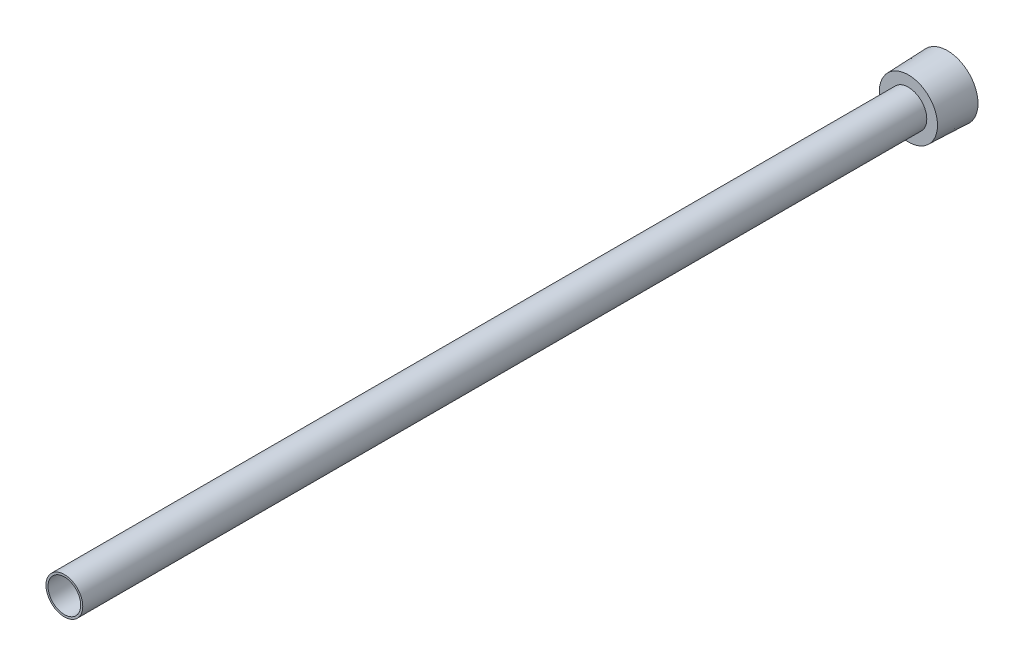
from build123d import *

# Parameters (mm, degrees)
SKETCH2_R          = 5.6388
CUT_EXTRUDE1_DEPTH = 306.164325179
CUT_EXTRUDE2_DEPTH = 9.525


with BuildPart() as part:
    # Sketch1 → Revolve1 (revolve)
    with BuildSketch(Plane(origin=(0, 0, 0), x_dir=(0, 0, -1), z_dir=(1, 0, 0)), mode=Mode.PRIVATE) as revolve1_sk:
        Polygon((0, 10.541), (-13.4874, 10.049032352), (-13.4874, 6.35), (-304.8, 6.35), (-304.8, 0), (0, 0), align=None)
    revolve(revolve1_sk.sketch.rotate(Axis((0, 0, 223.212151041), (0, 0, -1)), 90), axis=Axis((0, 0, 223.212151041), (0, 0, -1)))

    # Sketch2 → Cut-Extrude1 (cut, through all)
    with BuildSketch(Plane.XY.offset(304.8)):
        Circle(SKETCH2_R)
    extrude(amount=-CUT_EXTRUDE1_DEPTH, mode=Mode.SUBTRACT)

    # Sketch3 → Cut-Extrude2 (cut)
    with BuildSketch(Plane(origin=(0, 0, 0), x_dir=(-1, 0, 0), z_dir=(0, 0, -1))):
        Polygon((0, -7.332348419), (6.35, -3.666174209), (6.35, 3.666174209), (0, 7.332348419), (-6.35, 3.666174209), (-6.35, -3.666174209), align=None)
    extrude(amount=-CUT_EXTRUDE2_DEPTH, mode=Mode.SUBTRACT)


solid = part.part
